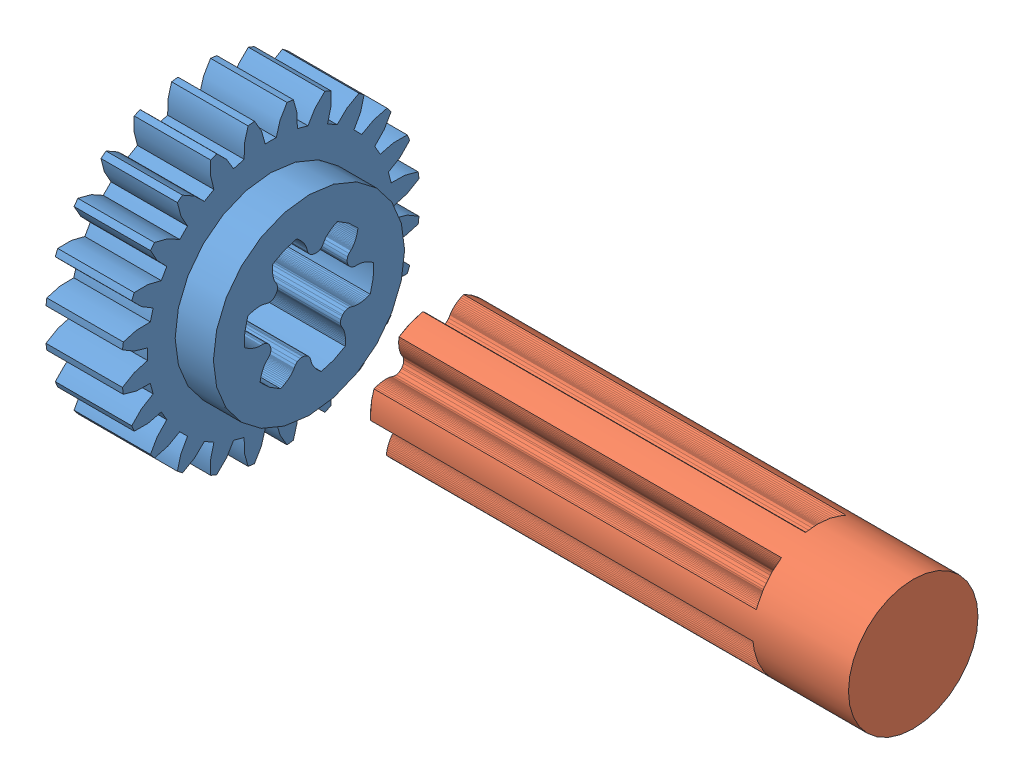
SolidWorks assembly 装配.SLDASM, configuration 默认 (file format 3400). Lengths in mm.
Overall size (188 77.53 77.53).
2 component instances, 2 part files, 1 mates.
Components (placement in the parent):
- 齿轮-1: 齿轮.SLDPRT [ISO - Spur gear 3M 24T 20PA 20FW ---S24C40H16L5.0N] at (-32.9982 -15.8555 0) size (30 77.53 77.53)
- 花键轴-1: 花键轴.SLDPRT [默认] at (79.9969 -15.8555 0) x (0 -0.924225 -0.381849) z (-1 0 0) size (33.87 33.87 125)
Mates (geometry in assembly coordinates):
- 同心1: concentric = 0 mm aligned: circle of 花键轴-1
